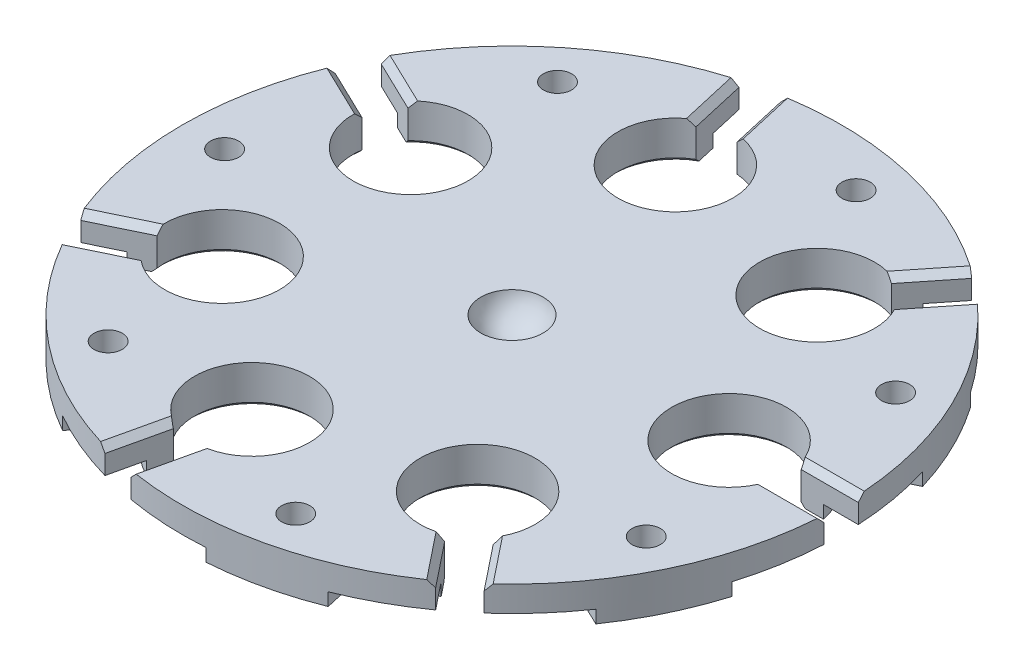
from build123d import *

# Parameters (mm, degrees)
SKETCH1_R                    = 65.532
EXTRUDE1_DEPTH               = 5.08
SKETCH3_R                    = 15.74165
EXTRUDE2_DEPTH               = 2.54
SKETCH4_R                    = 11.43
CUT_EXTRUDE2_DEPTH           = 93.98898025
EXTRUDE3_START               = 2.54
EXTRUDE3_DEPTH               = 2.54
SKETCH2_W                    = 45.853856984
SKETCH2_H                    = 6.858
CUT_EXTRUDE1_DEPTH           = 93.815367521
CHAMFER1_SIZE                = 1.27
F_12_CLEARANCE_HOLE1_D       = 5.6134
CHAMFER2_SIZE                = 0.762
CIRPATTERN2_COUNT            = 7
CHAMFER1_OF_CIRPATTERN2_SIZE = 1.27
CHAMFER2_OF_CIRPATTERN2_SIZE = 0.762


with BuildPart() as part:
    # Sketch1 → Extrude1 (new body)
    with BuildSketch(Plane(origin=(0, 0, 0), x_dir=(1, 0, 0), z_dir=(0, 1, 0))):
        with Locations(Location((0, 0, 0), (0, 0, 270))):
            Circle(SKETCH1_R)
    extrude(amount=EXTRUDE1_DEPTH)

    # Sketch3 → Extrude2 (add)
    with BuildSketch(Plane.XZ):
        with Locations(Location((43.18, 0, 0), (0, 0, 90))):
            Circle(SKETCH3_R)
    extrude2 = extrude(amount=EXTRUDE2_DEPTH)

    # Sketch4 → Cut-Extrude2 (cut, through all)
    with BuildSketch(Plane.XZ.offset(2.54)):
        with Locations(Location((43.18, 0, 0), (0, 0, 270))):
            Circle(SKETCH4_R)
    cut_extrude2 = extrude(amount=-CUT_EXTRUDE2_DEPTH, mode=Mode.SUBTRACT)

    # Sketch7 → Extrude3 (add)
    with BuildSketch(Plane.XZ.offset(EXTRUDE3_START)):
        with BuildLine():
            Line((57.858524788, -16.586447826), (62.736634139, -18.935621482))
            ThreePointArc((62.736634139, -18.935621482), (59.04229183, -28.433269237), (53.920116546, -37.243308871))
            Line((53.920116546, -37.243308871), (49.042007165, -34.8941352))
            ThreePointArc((49.042007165, -34.8941352), (48.360023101, -28.192354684), (45.694991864, -22.005548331))
            ThreePointArc((45.694991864, -22.005548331), (52.193651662, -20.231743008), (57.858524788, -16.586447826))
        make_face()
    extrude3 = extrude(amount=-EXTRUDE3_DEPTH)

    # Sketch2 → Cut-Extrude1 (cut, symmetric)
    with BuildSketch(Plane.XZ):
        with Locations((57.69796944, 0)):
            Rectangle(SKETCH2_W, SKETCH2_H)
    cut_extrude1 = extrude(amount=CUT_EXTRUDE1_DEPTH, both=True, mode=Mode.SUBTRACT)

    # Chamfer1
    chamfer1_edges = [part.edges().sort_by_distance(p)[0] for p in [
        (59.762875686, 5.08, -3.429),
        (59.762875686, 5.08, 3.429),
    ]]
    chamfer(chamfer1_edges, length=CHAMFER1_SIZE)

    # 12 Clearance Hole1 (through all)
    with Locations(Plane(origin=(0, 5.08, 0), x_dir=(-1, 0, 0), z_dir=(0, 1, 0))):
        with Locations((-51.49037073, -24.796455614)):
            f_12_clearance_hole1 = Hole(F_12_CLEARANCE_HOLE1_D / 2)

    # Chamfer2
    chamfer2_edges = [part.edges().sort_by_distance(p)[0] for p in [
        (31.75, -2.54, 0),
    ]]
    chamfer(chamfer2_edges, length=CHAMFER2_SIZE)

    # CirPattern2: Extrude2, Cut-Extrude2, Extrude3, Cut-Extrude1, 12 Clearance Hole1 ×7 about axis
    cirpattern2_axis = Axis((0, 0, 0), (0, 1, 0))
    add([extrude2.rotate(cirpattern2_axis, i * 360 / CIRPATTERN2_COUNT) for i in range(1, CIRPATTERN2_COUNT)])
    add([cut_extrude2.rotate(cirpattern2_axis, i * 360 / CIRPATTERN2_COUNT) for i in range(1, CIRPATTERN2_COUNT)], mode=Mode.SUBTRACT)
    add([extrude3.rotate(cirpattern2_axis, i * 360 / CIRPATTERN2_COUNT) for i in range(1, CIRPATTERN2_COUNT)])
    add([cut_extrude1.rotate(cirpattern2_axis, i * 360 / CIRPATTERN2_COUNT) for i in range(1, CIRPATTERN2_COUNT)], mode=Mode.SUBTRACT)
    add([f_12_clearance_hole1.rotate(cirpattern2_axis, i * 360 / CIRPATTERN2_COUNT) for i in range(1, CIRPATTERN2_COUNT)], mode=Mode.SUBTRACT)

    # Chamfer1 of CirPattern2
    chamfer1_of_cirpattern2_edges = [part.edges().sort_by_distance(p)[0] for p in [
        (34.580643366, 5.08, -48.862444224),
        (39.942443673, 5.08, -44.586551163),
        (-16.641518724, 5.08, -57.501471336),
        (-9.955463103, 5.08, -59.027519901),
        (-55.332277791, 5.08, -22.840717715),
        (-52.356703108, 5.08, -29.019562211),
        (-52.356703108, 5.08, 29.019562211),
        (-55.332277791, 5.08, 22.840717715),
        (-9.955463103, 5.08, 59.027519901),
        (-16.641518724, 5.08, 57.501471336),
        (39.942443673, 5.08, 44.586551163),
        (34.580643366, 5.08, 48.862444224),
    ]]
    chamfer(chamfer1_of_cirpattern2_edges, length=CHAMFER1_OF_CIRPATTERN2_SIZE)

    # Chamfer2 of CirPattern2
    chamfer2_of_cirpattern2_edges = [part.edges().sort_by_distance(p)[0] for p in [
        (19.795801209, -2.54, -24.823149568),
        (-7.065039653, -2.54, -30.953961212),
        (-28.605761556, -2.54, -13.775808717),
        (-28.605761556, -2.54, 13.775808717),
        (-7.065039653, -2.54, 30.953961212),
        (19.795801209, -2.54, 24.823149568),
    ]]
    chamfer(chamfer2_of_cirpattern2_edges, length=CHAMFER2_OF_CIRPATTERN2_SIZE)

    # Sketch11 → Cut-Revolve6 (revolve, cut)
    with BuildSketch(Plane(origin=(0, 0, 0), x_dir=(0, 0, -1), z_dir=(1, 0, 0))):
        with BuildLine():
            Line((-6.194424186, 5.08), (0, 5.08))
            Line((0, 5.08), (0, 0.127))
            ThreePointArc((0, 0.127), (-3.965573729, 1.517491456), (-6.194424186, 5.08))
        make_face()
    revolve(axis=Axis((0, 6.477, 0), (0, -1, 0)), mode=Mode.SUBTRACT)


solid = part.part
